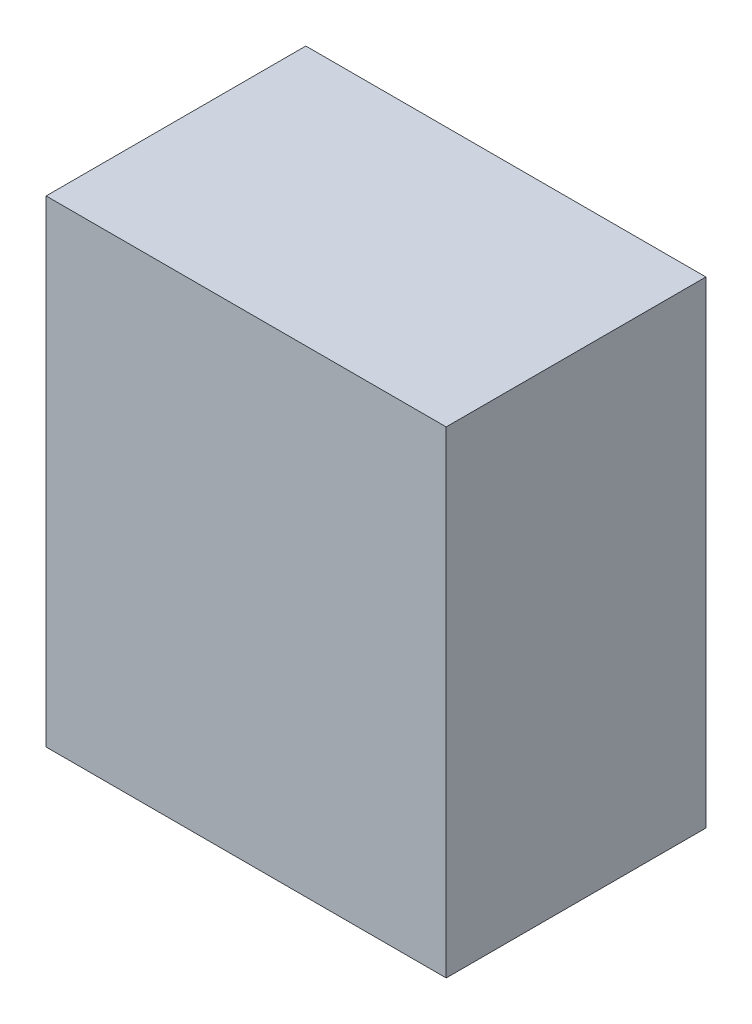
ISO-10303-21;
HEADER;
FILE_DESCRIPTION(('STEP AP214'),'2;1');
FILE_NAME('part.step','',(''),(''),'','','');
FILE_SCHEMA(('AUTOMOTIVE_DESIGN { 1 0 10303 214 1 1 1 1 }'));
ENDSEC;
DATA;
#1=APPLICATION_CONTEXT('core data for automotive mechanical design processes');
#2=APPLICATION_PROTOCOL_DEFINITION('international standard','automotive_design',2000,#1);
#3=PRODUCT_CONTEXT('',#1,'mechanical');
#4=PRODUCT('Part','Part','',(#3));
#5=PRODUCT_RELATED_PRODUCT_CATEGORY('part','',(#4));
#6=PRODUCT_DEFINITION_FORMATION('','',#4);
#7=PRODUCT_DEFINITION_CONTEXT('part definition',#1,'design');
#8=PRODUCT_DEFINITION('design','',#6,#7);
#9=PRODUCT_DEFINITION_SHAPE('','',#8);
#10=(LENGTH_UNIT() NAMED_UNIT(*) SI_UNIT(.MILLI.,.METRE.));
#11=(NAMED_UNIT(*) PLANE_ANGLE_UNIT() SI_UNIT($,.RADIAN.));
#12=(NAMED_UNIT(*) SI_UNIT($,.STERADIAN.) SOLID_ANGLE_UNIT());
#13=UNCERTAINTY_MEASURE_WITH_UNIT(LENGTH_MEASURE(1.E-05),#10,'distance_accuracy_value','');
#14=(GEOMETRIC_REPRESENTATION_CONTEXT(3) GLOBAL_UNCERTAINTY_ASSIGNED_CONTEXT((#13)) GLOBAL_UNIT_ASSIGNED_CONTEXT((#10,
#11,#12)) REPRESENTATION_CONTEXT('',''));
#15=CARTESIAN_POINT('',(0.,0.,0.));
#16=DIRECTION('',(0.,0.,1.));
#17=DIRECTION('',(1.,0.,0.));
#18=AXIS2_PLACEMENT_3D('',#15,#16,#17);
#19=CARTESIAN_POINT('',(28.5,68.,-18.5));
#20=DIRECTION('',(-1.,0.,0.));
#21=DIRECTION('',(0.,0.,1.));
#22=AXIS2_PLACEMENT_3D('',#19,#20,#21);
#23=PLANE('',#22);
#24=DIRECTION('',(0.,0.,-1.));
#25=VECTOR('',#24,1.);
#26=CARTESIAN_POINT('',(28.5,0.,-18.5));
#27=LINE('',#26,#25);
#28=CARTESIAN_POINT('',(28.5,0.,18.5));
#29=VERTEX_POINT('',#28);
#30=CARTESIAN_POINT('',(28.5,0.,-18.5));
#31=VERTEX_POINT('',#30);
#32=EDGE_CURVE('E102',#29,#31,#27,.T.);
#33=ORIENTED_EDGE('',*,*,#32,.T.);
#34=DIRECTION('',(0.,-1.,0.));
#35=VECTOR('',#34,1.);
#36=CARTESIAN_POINT('',(28.5,68.,-18.5));
#37=LINE('',#36,#35);
#38=CARTESIAN_POINT('',(28.5,68.,-18.5));
#39=VERTEX_POINT('',#38);
#40=EDGE_CURVE('E11',#39,#31,#37,.T.);
#41=ORIENTED_EDGE('',*,*,#40,.F.);
#42=DIRECTION('',(0.,0.,-1.));
#43=VECTOR('',#42,1.);
#44=CARTESIAN_POINT('',(28.5,68.,-18.5));
#45=LINE('',#44,#43);
#46=CARTESIAN_POINT('',(28.5,68.,18.5));
#47=VERTEX_POINT('',#46);
#48=EDGE_CURVE('E90',#47,#39,#45,.T.);
#49=ORIENTED_EDGE('',*,*,#48,.F.);
#50=DIRECTION('',(0.,-1.,0.));
#51=VECTOR('',#50,1.);
#52=CARTESIAN_POINT('',(28.5,68.,18.5));
#53=LINE('',#52,#51);
#54=EDGE_CURVE('E98',#47,#29,#53,.T.);
#55=ORIENTED_EDGE('',*,*,#54,.T.);
#56=EDGE_LOOP('',(#33,#41,#49,#55));
#57=FACE_BOUND('',#56,.T.);
#58=ADVANCED_FACE('F39',(#57),#23,.F.);
#59=CARTESIAN_POINT('',(-28.5,68.,-18.5));
#60=DIRECTION('',(0.,0.,1.));
#61=DIRECTION('',(1.,0.,0.));
#62=AXIS2_PLACEMENT_3D('',#59,#60,#61);
#63=PLANE('',#62);
#64=DIRECTION('',(-1.,0.,0.));
#65=VECTOR('',#64,1.);
#66=CARTESIAN_POINT('',(-28.5,0.,-18.5));
#67=LINE('',#66,#65);
#68=CARTESIAN_POINT('',(-28.5,0.,-18.5));
#69=VERTEX_POINT('',#68);
#70=EDGE_CURVE('E94',#31,#69,#67,.T.);
#71=ORIENTED_EDGE('',*,*,#70,.T.);
#72=DIRECTION('',(0.,-1.,0.));
#73=VECTOR('',#72,1.);
#74=CARTESIAN_POINT('',(-28.5,68.,-18.5));
#75=LINE('',#74,#73);
#76=CARTESIAN_POINT('',(-28.5,68.,-18.5));
#77=VERTEX_POINT('',#76);
#78=EDGE_CURVE('E47',#77,#69,#75,.T.);
#79=ORIENTED_EDGE('',*,*,#78,.F.);
#80=DIRECTION('',(-1.,0.,0.));
#81=VECTOR('',#80,1.);
#82=CARTESIAN_POINT('',(-28.5,68.,-18.5));
#83=LINE('',#82,#81);
#84=EDGE_CURVE('E85',#39,#77,#83,.T.);
#85=ORIENTED_EDGE('',*,*,#84,.F.);
#86=ORIENTED_EDGE('',*,*,#40,.T.);
#87=EDGE_LOOP('',(#71,#79,#85,#86));
#88=FACE_BOUND('',#87,.T.);
#89=ADVANCED_FACE('F93',(#88),#63,.F.);
#90=CARTESIAN_POINT('',(-28.5,68.,-18.5));
#91=DIRECTION('',(1.,0.,0.));
#92=DIRECTION('',(0.,0.,-1.));
#93=AXIS2_PLACEMENT_3D('',#90,#91,#92);
#94=PLANE('',#93);
#95=DIRECTION('',(0.,0.,1.));
#96=VECTOR('',#95,1.);
#97=CARTESIAN_POINT('',(-28.5,0.,-18.5));
#98=LINE('',#97,#96);
#99=CARTESIAN_POINT('',(-28.5,0.,18.5));
#100=VERTEX_POINT('',#99);
#101=EDGE_CURVE('E72',#69,#100,#98,.T.);
#102=ORIENTED_EDGE('',*,*,#101,.T.);
#103=DIRECTION('',(0.,-1.,0.));
#104=VECTOR('',#103,1.);
#105=CARTESIAN_POINT('',(-28.5,68.,18.5));
#106=LINE('',#105,#104);
#107=CARTESIAN_POINT('',(-28.5,68.,18.5));
#108=VERTEX_POINT('',#107);
#109=EDGE_CURVE('E95',#108,#100,#106,.T.);
#110=ORIENTED_EDGE('',*,*,#109,.F.);
#111=DIRECTION('',(0.,0.,1.));
#112=VECTOR('',#111,1.);
#113=CARTESIAN_POINT('',(-28.5,68.,-18.5));
#114=LINE('',#113,#112);
#115=EDGE_CURVE('E88',#77,#108,#114,.T.);
#116=ORIENTED_EDGE('',*,*,#115,.F.);
#117=ORIENTED_EDGE('',*,*,#78,.T.);
#118=EDGE_LOOP('',(#102,#110,#116,#117));
#119=FACE_BOUND('',#118,.T.);
#120=ADVANCED_FACE('F96',(#119),#94,.F.);
#121=CARTESIAN_POINT('',(-28.5,68.,18.5));
#122=DIRECTION('',(0.,0.,-1.));
#123=DIRECTION('',(-1.,0.,0.));
#124=AXIS2_PLACEMENT_3D('',#121,#122,#123);
#125=PLANE('',#124);
#126=DIRECTION('',(1.,0.,0.));
#127=VECTOR('',#126,1.);
#128=CARTESIAN_POINT('',(-28.5,0.,18.5));
#129=LINE('',#128,#127);
#130=EDGE_CURVE('E78',#100,#29,#129,.T.);
#131=ORIENTED_EDGE('',*,*,#130,.T.);
#132=ORIENTED_EDGE('',*,*,#54,.F.);
#133=DIRECTION('',(1.,0.,0.));
#134=VECTOR('',#133,1.);
#135=CARTESIAN_POINT('',(-28.5,68.,18.5));
#136=LINE('',#135,#134);
#137=EDGE_CURVE('E55',#108,#47,#136,.T.);
#138=ORIENTED_EDGE('',*,*,#137,.F.);
#139=ORIENTED_EDGE('',*,*,#109,.T.);
#140=EDGE_LOOP('',(#131,#132,#138,#139));
#141=FACE_BOUND('',#140,.T.);
#142=ADVANCED_FACE('F109',(#141),#125,.F.);
#143=CARTESIAN_POINT('',(0.,68.,0.));
#144=DIRECTION('',(0.,1.,0.));
#145=DIRECTION('',(0.,0.,1.));
#146=AXIS2_PLACEMENT_3D('',#143,#144,#145);
#147=PLANE('',#146);
#148=ORIENTED_EDGE('',*,*,#48,.T.);
#149=ORIENTED_EDGE('',*,*,#84,.T.);
#150=ORIENTED_EDGE('',*,*,#115,.T.);
#151=ORIENTED_EDGE('',*,*,#137,.T.);
#152=EDGE_LOOP('',(#148,#149,#150,#151));
#153=FACE_BOUND('',#152,.T.);
#154=ADVANCED_FACE('F86',(#153),#147,.T.);
#155=CARTESIAN_POINT('',(0.,0.,0.));
#156=DIRECTION('',(0.,1.,0.));
#157=DIRECTION('',(0.,0.,1.));
#158=AXIS2_PLACEMENT_3D('',#155,#156,#157);
#159=PLANE('',#158);
#160=ORIENTED_EDGE('',*,*,#32,.F.);
#161=ORIENTED_EDGE('',*,*,#130,.F.);
#162=ORIENTED_EDGE('',*,*,#101,.F.);
#163=ORIENTED_EDGE('',*,*,#70,.F.);
#164=EDGE_LOOP('',(#160,#161,#162,#163));
#165=FACE_BOUND('',#164,.T.);
#166=ADVANCED_FACE('F112',(#165),#159,.F.);
#167=CLOSED_SHELL('',(#58,#89,#120,#142,#154,#166));
#168=MANIFOLD_SOLID_BREP('B2',#167);
#169=ADVANCED_BREP_SHAPE_REPRESENTATION('',(#18,#168),#14);
#170=SHAPE_DEFINITION_REPRESENTATION(#9,#169);
ENDSEC;
END-ISO-10303-21;
